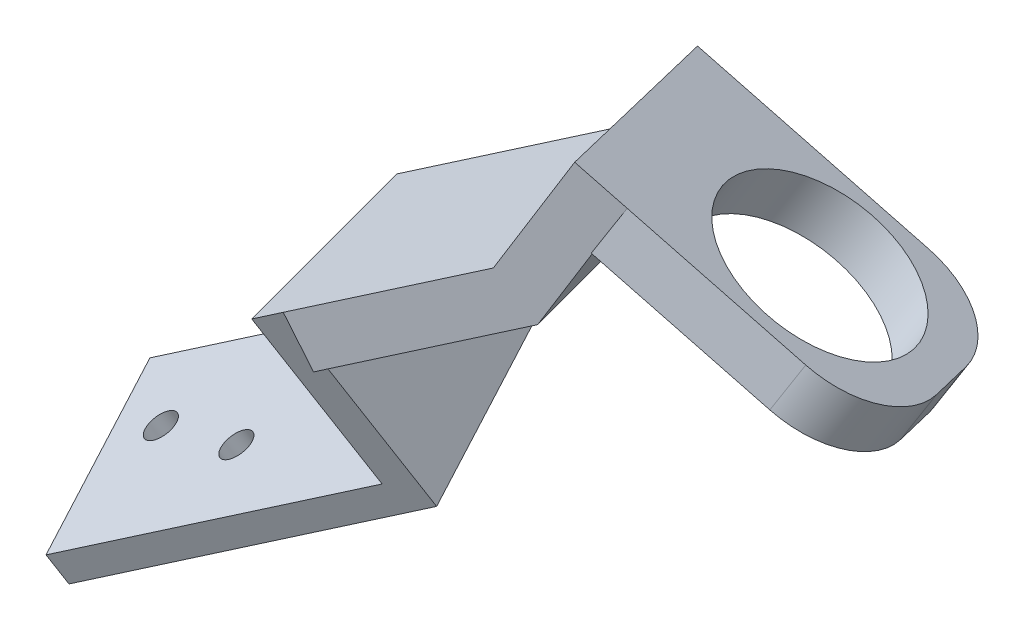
from build123d import *

# Parameters (mm, degrees)
EXTRUDE_3_DEPTH     = 20
SKETCH_6_R          = 1.5
CUT_EXTRUDE_3_DEPTH = 20
EXTRUDE_4_DEPTH     = 20
EXTRUDE_6_DEPTH     = 20.705523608
EXTRUDE_7_DEPTH     = 25
SKETCH_11_R         = 9
CUT_EXTRUDE_4_DEPTH = 22
CUT_EXTRUDE_5_DEPTH = 22
CUT_EXTRUDE_6_DEPTH = 22
CUT_EXTRUDE_7_DEPTH = 75
FILLET_1_R          = 8


with BuildPart() as part:
    # Sketch 5 → Extrude 3 (new body)
    with BuildSketch(Plane.XY):
        Polygon((0, 0), (0, 35), (20, 35), (20, 32), (3, 32), (3, 0), align=None)
    extrude(amount=EXTRUDE_3_DEPTH)

    # Sketch 6 → Cut-Extrude 3 (cut)
    with BuildSketch(Plane.ZY):
        with Locations(Location((12, 14.16515139, 0), (0, 0, 270))):
            Circle(SKETCH_6_R)
        with Locations(Location((8, 5, 0), (0, 0, 270))):
            Circle(SKETCH_6_R)
    extrude(amount=-CUT_EXTRUDE_3_DEPTH, mode=Mode.SUBTRACT)

    # Sketch 7 → Extrude 4 (add)
    with BuildSketch(Plane(origin=(0, 35, 0), x_dir=(1, 0, 0), z_dir=(0, 1, 0))):
        Polygon((20, -20), (14.641016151, 0), (9.81138702, -1.294095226), (15.170370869, -21.294095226), align=None)
    extrude(amount=EXTRUDE_4_DEPTH)

    # Sketch 9 → Extrude 6 (add)
    with BuildSketch(Plane(origin=(6.339745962, 0, 23.660254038), x_dir=(0.965925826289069, 0, -0.2588190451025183), z_dir=(0.2588190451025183, 0, 0.965925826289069))):
        Polygon((14.142135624, 55), (26.642135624, 76.650635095), (22.312008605, 79.150635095), (9.142135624, 56.339745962), (9.142135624, 55), align=None)
    extrude(amount=-EXTRUDE_6_DEPTH)

    # Sketch 10 → Extrude 7 (add)
    with BuildSketch(Plane(origin=(-16.941589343, 10.126275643, 4.539485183), x_dir=(0.19239529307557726, -0.1149979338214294, 0.9745560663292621), z_dir=(-0.8365163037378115, 0.4999999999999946, 0.22414386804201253))):
        Polygon((15.232581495, 70.768416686), (-4.804781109, 64.40035665), (-3.290374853, 59.635215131), (16.746987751, 66.003275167), align=None)
    extrude(amount=EXTRUDE_7_DEPTH)

    # Sketch 11 → Cut-Extrude 4 (cut)
    with BuildSketch(Plane(origin=(27.060036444, 53.586276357, -18.546019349), x_dir=(0.9025036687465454, -0.4069958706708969, 0.14085982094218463), z_dir=(0.43068216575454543, 0.8528685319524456, -0.2951747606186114))):
        with Locations(Location((-20.809335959, -35.872633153, 0), (0, 0, 188.477948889))):
            Circle(SKETCH_11_R)
    extrude(amount=-CUT_EXTRUDE_4_DEPTH, mode=Mode.SUBTRACT)

    # Sketch 12 → Cut-Extrude 5 (cut)
    with BuildSketch(Plane(origin=(0, 35, 0), x_dir=(1, 0, 0), z_dir=(0, 1, 0))):
        Polygon((14.641016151, 0), (20, -20), (20, 0), align=None)
    extrude(amount=-CUT_EXTRUDE_5_DEPTH, mode=Mode.SUBTRACT)

    # Sketch 13 → Cut-Extrude 6 (cut)
    with BuildSketch(Plane(origin=(-16.941589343, 10.126275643, 4.539485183), x_dir=(0.19239529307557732, -0.11499793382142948, 0.974556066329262), z_dir=(-0.8365163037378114, 0.49999999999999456, 0.2241438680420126))):
        Polygon((-6.827728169, 79.499839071), (-4.804781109, 64.40035665), (15.232581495, 70.768416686), (13.694436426, 82.249287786), align=None)
    extrude(amount=-CUT_EXTRUDE_6_DEPTH, mode=Mode.SUBTRACT)

    # Mirror 2: part across plane


with BuildPart() as part_1:
    add(part.part)
    add(part.part.mirror(Plane(origin=(-37.854496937, 22.626275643, 10.143081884), x_dir=(0.19239529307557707, -0.11499793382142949, 0.974556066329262), z_dir=(-0.836516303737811, 0.49999999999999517, 0.22414386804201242))))

    # Sketch 14 → Cut-Extrude 7 (cut)
    with BuildSketch(Plane(origin=(27.060036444, 53.586276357, -18.546019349), x_dir=(0.9025036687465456, -0.40699587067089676, 0.14085982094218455), z_dir=(0.43068216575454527, 0.8528685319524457, -0.29517476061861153))):
        Polygon((-36.34121811, -30.820637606), (-28.449556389, -50.308319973), (-22.346856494, -65.37833708), (34.999724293, -42.155472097), (13.965400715, 9.786720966), (-43.381180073, -13.436144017), align=None)
    extrude(amount=-CUT_EXTRUDE_7_DEPTH, mode=Mode.SUBTRACT)

    # Fillet 1
    fillet_1_edges = [part_1.edges().sort_by_distance(p)[0] for p in [
        (0.307502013, 79.48690264, 25.726023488),
        (-6.814751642, 76.32509372, 6.198490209),
    ]]
    fillet(fillet_1_edges, radius=FILLET_1_R)


solid = part_1.part
